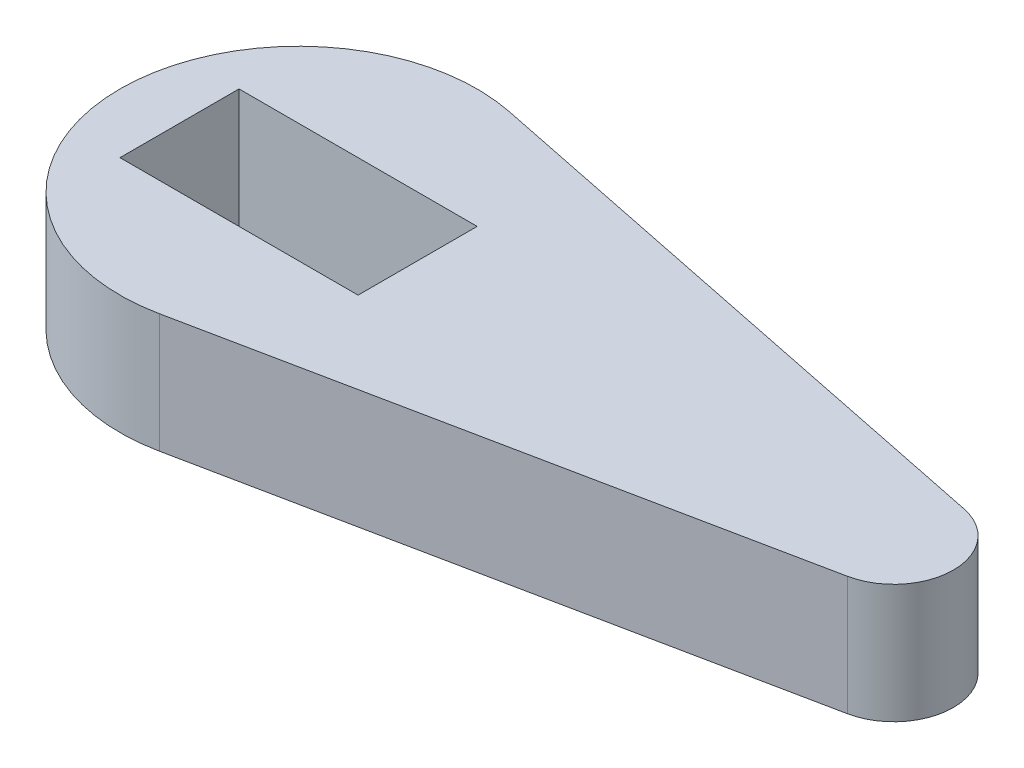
from build123d import *

# Parameters (mm, degrees)
BASE_EXTRUDE_DEPTH = 3.175
SKETCH2_W          = 6.35
SKETCH2_H          = 3.175
CUT_EXTRUDE1_DEPTH = 19.376641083


with BuildPart() as part:
    # Sketch1 → Base-Extrude (new body)
    with BuildSketch(Plane(origin=(0, 0, 0), x_dir=(1, 0, 0), z_dir=(0, 1, 0))):
        with BuildLine():
            Line((0.9525, 4.66627796), (16.1925, 1.555425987))
            ThreePointArc((16.1925, 1.555425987), (17.4625, 0), (16.1925, -1.555425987))
            Line((16.1925, -1.555425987), (0.9525, -4.66627796))
            ThreePointArc((0.9525, -4.66627796), (-4.7625, 0), (0.9525, 4.66627796))
        make_face()
    extrude(amount=BASE_EXTRUDE_DEPTH)

    # Sketch2 → Cut-Extrude1 (cut, through all)
    with BuildSketch(Plane(origin=(0, 3.175, 0), x_dir=(-1, 0, 0), z_dir=(0, 1, 0))):
        Rectangle(SKETCH2_W, SKETCH2_H)
    extrude(amount=-CUT_EXTRUDE1_DEPTH, mode=Mode.SUBTRACT)


solid = part.part
